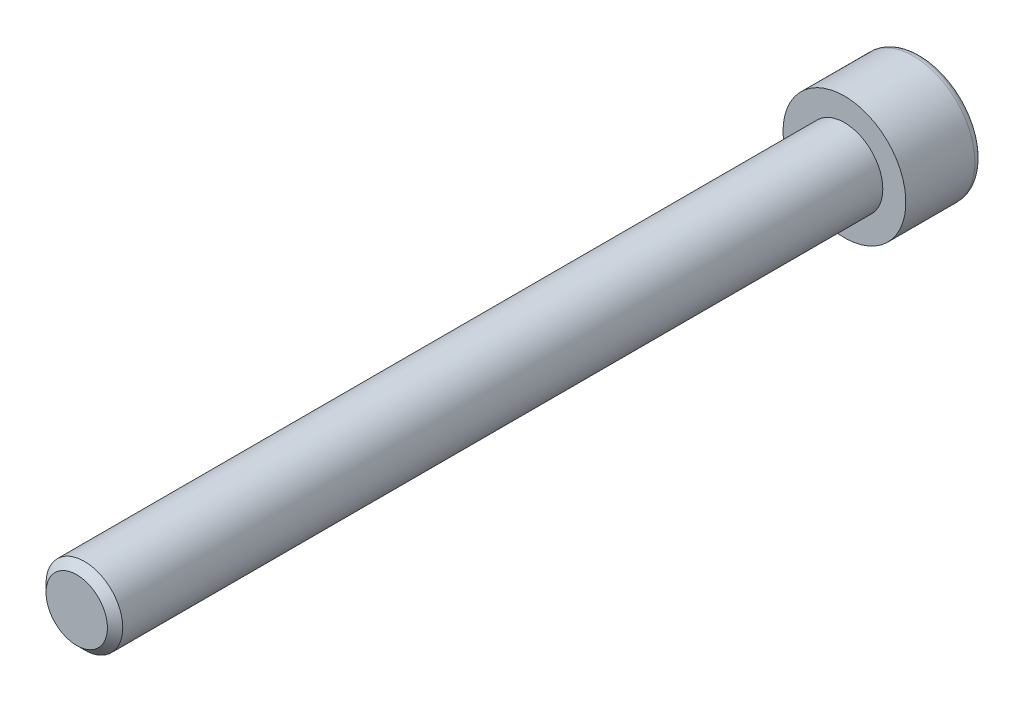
ISO-10303-21;
HEADER;
FILE_DESCRIPTION(('STEP AP214'),'2;1');
FILE_NAME('part.step','',(''),(''),'','','');
FILE_SCHEMA(('AUTOMOTIVE_DESIGN { 1 0 10303 214 1 1 1 1 }'));
ENDSEC;
DATA;
#1=APPLICATION_CONTEXT('core data for automotive mechanical design processes');
#2=APPLICATION_PROTOCOL_DEFINITION('international standard','automotive_design',2000,#1);
#3=PRODUCT_CONTEXT('',#1,'mechanical');
#4=PRODUCT('Part','Part','',(#3));
#5=PRODUCT_RELATED_PRODUCT_CATEGORY('part','',(#4));
#6=PRODUCT_DEFINITION_FORMATION('','',#4);
#7=PRODUCT_DEFINITION_CONTEXT('part definition',#1,'design');
#8=PRODUCT_DEFINITION('design','',#6,#7);
#9=PRODUCT_DEFINITION_SHAPE('','',#8);
#10=(LENGTH_UNIT() NAMED_UNIT(*) SI_UNIT(.MILLI.,.METRE.));
#11=(NAMED_UNIT(*) PLANE_ANGLE_UNIT() SI_UNIT($,.RADIAN.));
#12=(NAMED_UNIT(*) SI_UNIT($,.STERADIAN.) SOLID_ANGLE_UNIT());
#13=UNCERTAINTY_MEASURE_WITH_UNIT(LENGTH_MEASURE(1.E-05),#10,'distance_accuracy_value','');
#14=(GEOMETRIC_REPRESENTATION_CONTEXT(3) GLOBAL_UNCERTAINTY_ASSIGNED_CONTEXT((#13)) GLOBAL_UNIT_ASSIGNED_CONTEXT((#10,
#11,#12)) REPRESENTATION_CONTEXT('',''));
#15=CARTESIAN_POINT('',(0.,0.,0.));
#16=DIRECTION('',(0.,0.,1.));
#17=DIRECTION('',(1.,0.,0.));
#18=AXIS2_PLACEMENT_3D('',#15,#16,#17);
#19=CARTESIAN_POINT('',(0.,0.,-10.));
#20=DIRECTION('',(0.,0.,1.));
#21=DIRECTION('',(1.,0.,0.));
#22=AXIS2_PLACEMENT_3D('',#19,#20,#21);
#23=PLANE('',#22);
#24=CARTESIAN_POINT('',(0.,0.,-10.));
#25=DIRECTION('',(0.,0.,-1.));
#26=DIRECTION('',(-1.,0.,0.));
#27=AXIS2_PLACEMENT_3D('',#24,#25,#26);
#28=CIRCLE('',#27,7.);
#29=CARTESIAN_POINT('',(-7.,0.,-10.));
#30=VERTEX_POINT('',#29);
#31=EDGE_CURVE('E143',#30,#30,#28,.T.);
#32=ORIENTED_EDGE('',*,*,#31,.T.);
#33=EDGE_LOOP('',(#32));
#34=FACE_BOUND('',#33,.T.);
#35=DIRECTION('',(-0.86602540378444,0.499999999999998,0.));
#36=VECTOR('',#35,1.);
#37=CARTESIAN_POINT('',(0.,4.61880215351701,-10.));
#38=LINE('',#37,#36);
#39=CARTESIAN_POINT('',(4.,2.30940107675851,-10.));
#40=VERTEX_POINT('',#39);
#41=CARTESIAN_POINT('',(0.,4.61880215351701,-10.));
#42=VERTEX_POINT('',#41);
#43=EDGE_CURVE('E47',#40,#42,#38,.T.);
#44=ORIENTED_EDGE('',*,*,#43,.T.);
#45=DIRECTION('',(-0.866025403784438,-0.500000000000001,0.));
#46=VECTOR('',#45,1.);
#47=CARTESIAN_POINT('',(0.,4.61880215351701,-10.));
#48=LINE('',#47,#46);
#49=CARTESIAN_POINT('',(-4.,2.30940107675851,-10.));
#50=VERTEX_POINT('',#49);
#51=EDGE_CURVE('E87',#42,#50,#48,.T.);
#52=ORIENTED_EDGE('',*,*,#51,.T.);
#53=DIRECTION('',(0.,-1.,0.));
#54=VECTOR('',#53,1.);
#55=CARTESIAN_POINT('',(-4.,-2.30940107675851,-10.));
#56=LINE('',#55,#54);
#57=CARTESIAN_POINT('',(-4.,-2.30940107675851,-10.));
#58=VERTEX_POINT('',#57);
#59=EDGE_CURVE('E95',#50,#58,#56,.T.);
#60=ORIENTED_EDGE('',*,*,#59,.T.);
#61=DIRECTION('',(0.866025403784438,-0.500000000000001,0.));
#62=VECTOR('',#61,1.);
#63=CARTESIAN_POINT('',(0.,-4.61880215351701,-10.));
#64=LINE('',#63,#62);
#65=CARTESIAN_POINT('',(0.,-4.61880215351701,-10.));
#66=VERTEX_POINT('',#65);
#67=EDGE_CURVE('E113',#58,#66,#64,.T.);
#68=ORIENTED_EDGE('',*,*,#67,.T.);
#69=DIRECTION('',(0.86602540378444,0.499999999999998,0.));
#70=VECTOR('',#69,1.);
#71=CARTESIAN_POINT('',(0.,-4.61880215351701,-10.));
#72=LINE('',#71,#70);
#73=CARTESIAN_POINT('',(4.,-2.30940107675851,-10.));
#74=VERTEX_POINT('',#73);
#75=EDGE_CURVE('E116',#66,#74,#72,.T.);
#76=ORIENTED_EDGE('',*,*,#75,.T.);
#77=DIRECTION('',(0.,1.,0.));
#78=VECTOR('',#77,1.);
#79=CARTESIAN_POINT('',(4.,-2.30940107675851,-10.));
#80=LINE('',#79,#78);
#81=EDGE_CURVE('E106',#74,#40,#80,.T.);
#82=ORIENTED_EDGE('',*,*,#81,.T.);
#83=EDGE_LOOP('',(#44,#52,#60,#68,#76,#82));
#84=FACE_BOUND('',#83,.T.);
#85=ADVANCED_FACE('F33',(#34,#84),#23,.F.);
#86=CARTESIAN_POINT('',(0.,0.,-9.));
#87=DIRECTION('',(0.,0.,-1.));
#88=DIRECTION('',(-1.,0.,0.));
#89=AXIS2_PLACEMENT_3D('',#86,#87,#88);
#90=TOROIDAL_SURFACE('',#89,7.,0.999999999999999);
#91=ORIENTED_EDGE('',*,*,#31,.F.);
#92=EDGE_LOOP('',(#91));
#93=FACE_BOUND('',#92,.T.);
#94=CARTESIAN_POINT('',(0.,0.,-9.));
#95=DIRECTION('',(0.,0.,-1.));
#96=DIRECTION('',(-1.,0.,0.));
#97=AXIS2_PLACEMENT_3D('',#94,#95,#96);
#98=CIRCLE('',#97,8.);
#99=CARTESIAN_POINT('',(-8.,0.,-9.));
#100=VERTEX_POINT('',#99);
#101=EDGE_CURVE('E140',#100,#100,#98,.T.);
#102=ORIENTED_EDGE('',*,*,#101,.T.);
#103=EDGE_LOOP('',(#102));
#104=FACE_BOUND('',#103,.T.);
#105=ADVANCED_FACE('F162',(#93,#104),#90,.T.);
#106=CARTESIAN_POINT('',(0.,0.,0.));
#107=DIRECTION('',(0.,0.,-1.));
#108=DIRECTION('',(-1.,0.,0.));
#109=AXIS2_PLACEMENT_3D('',#106,#107,#108);
#110=CYLINDRICAL_SURFACE('',#109,8.);
#111=ORIENTED_EDGE('',*,*,#101,.F.);
#112=EDGE_LOOP('',(#111));
#113=FACE_BOUND('',#112,.T.);
#114=CARTESIAN_POINT('',(0.,0.,0.));
#115=DIRECTION('',(0.,0.,-1.));
#116=DIRECTION('',(-1.,0.,0.));
#117=AXIS2_PLACEMENT_3D('',#114,#115,#116);
#118=CIRCLE('',#117,8.);
#119=CARTESIAN_POINT('',(-8.,0.,0.));
#120=VERTEX_POINT('',#119);
#121=EDGE_CURVE('E101',#120,#120,#118,.T.);
#122=ORIENTED_EDGE('',*,*,#121,.T.);
#123=EDGE_LOOP('',(#122));
#124=FACE_BOUND('',#123,.T.);
#125=ADVANCED_FACE('F167',(#113,#124),#110,.T.);
#126=CARTESIAN_POINT('',(0.,0.,0.));
#127=DIRECTION('',(0.,0.,-1.));
#128=DIRECTION('',(-1.,0.,0.));
#129=AXIS2_PLACEMENT_3D('',#126,#127,#128);
#130=PLANE('',#129);
#131=CARTESIAN_POINT('',(0.,0.,0.));
#132=DIRECTION('',(0.,0.,1.));
#133=DIRECTION('',(1.,0.,0.));
#134=AXIS2_PLACEMENT_3D('',#131,#132,#133);
#135=CIRCLE('',#134,5.);
#136=CARTESIAN_POINT('',(5.,0.,0.));
#137=VERTEX_POINT('',#136);
#138=EDGE_CURVE('E107',#137,#137,#135,.T.);
#139=ORIENTED_EDGE('',*,*,#138,.F.);
#140=EDGE_LOOP('',(#139));
#141=FACE_BOUND('',#140,.T.);
#142=ORIENTED_EDGE('',*,*,#121,.F.);
#143=EDGE_LOOP('',(#142));
#144=FACE_BOUND('',#143,.T.);
#145=ADVANCED_FACE('F175',(#141,#144),#130,.F.);
#146=CARTESIAN_POINT('',(0.,4.61880215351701,-5.));
#147=DIRECTION('',(-0.499999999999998,-0.86602540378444,0.));
#148=DIRECTION('',(0.86602540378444,-0.499999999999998,0.));
#149=AXIS2_PLACEMENT_3D('',#146,#147,#148);
#150=PLANE('',#149);
#151=ORIENTED_EDGE('',*,*,#43,.F.);
#152=DIRECTION('',(0.,0.,-1.));
#153=VECTOR('',#152,1.);
#154=CARTESIAN_POINT('',(4.,2.30940107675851,-5.));
#155=LINE('',#154,#153);
#156=CARTESIAN_POINT('',(4.,2.30940107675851,-5.));
#157=VERTEX_POINT('',#156);
#158=EDGE_CURVE('E129',#157,#40,#155,.T.);
#159=ORIENTED_EDGE('',*,*,#158,.F.);
#160=DIRECTION('',(-0.86602540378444,0.499999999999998,0.));
#161=VECTOR('',#160,1.);
#162=CARTESIAN_POINT('',(0.,4.61880215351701,-5.));
#163=LINE('',#162,#161);
#164=CARTESIAN_POINT('',(0.,4.61880215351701,-5.));
#165=VERTEX_POINT('',#164);
#166=EDGE_CURVE('E100',#157,#165,#163,.T.);
#167=ORIENTED_EDGE('',*,*,#166,.T.);
#168=DIRECTION('',(0.,0.,-1.));
#169=VECTOR('',#168,1.);
#170=CARTESIAN_POINT('',(0.,4.61880215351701,-5.));
#171=LINE('',#170,#169);
#172=EDGE_CURVE('E89',#165,#42,#171,.T.);
#173=ORIENTED_EDGE('',*,*,#172,.T.);
#174=EDGE_LOOP('',(#151,#159,#167,#173));
#175=FACE_BOUND('',#174,.T.);
#176=ADVANCED_FACE('F98',(#175),#150,.T.);
#177=CARTESIAN_POINT('',(0.,4.61880215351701,-5.));
#178=DIRECTION('',(0.500000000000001,-0.866025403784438,0.));
#179=DIRECTION('',(0.866025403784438,0.500000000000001,0.));
#180=AXIS2_PLACEMENT_3D('',#177,#178,#179);
#181=PLANE('',#180);
#182=ORIENTED_EDGE('',*,*,#51,.F.);
#183=ORIENTED_EDGE('',*,*,#172,.F.);
#184=DIRECTION('',(-0.866025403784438,-0.500000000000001,0.));
#185=VECTOR('',#184,1.);
#186=CARTESIAN_POINT('',(0.,4.61880215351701,-5.));
#187=LINE('',#186,#185);
#188=CARTESIAN_POINT('',(-4.,2.30940107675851,-5.));
#189=VERTEX_POINT('',#188);
#190=EDGE_CURVE('E120',#165,#189,#187,.T.);
#191=ORIENTED_EDGE('',*,*,#190,.T.);
#192=DIRECTION('',(0.,0.,-1.));
#193=VECTOR('',#192,1.);
#194=CARTESIAN_POINT('',(-4.,2.30940107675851,-5.));
#195=LINE('',#194,#193);
#196=EDGE_CURVE('E91',#189,#50,#195,.T.);
#197=ORIENTED_EDGE('',*,*,#196,.T.);
#198=EDGE_LOOP('',(#182,#183,#191,#197));
#199=FACE_BOUND('',#198,.T.);
#200=ADVANCED_FACE('F88',(#199),#181,.T.);
#201=CARTESIAN_POINT('',(-4.,-2.30940107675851,-5.));
#202=DIRECTION('',(1.,0.,0.));
#203=DIRECTION('',(0.,0.,-1.));
#204=AXIS2_PLACEMENT_3D('',#201,#202,#203);
#205=PLANE('',#204);
#206=ORIENTED_EDGE('',*,*,#59,.F.);
#207=ORIENTED_EDGE('',*,*,#196,.F.);
#208=DIRECTION('',(0.,-1.,0.));
#209=VECTOR('',#208,1.);
#210=CARTESIAN_POINT('',(-4.,-2.30940107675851,-5.));
#211=LINE('',#210,#209);
#212=CARTESIAN_POINT('',(-4.,-2.30940107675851,-5.));
#213=VERTEX_POINT('',#212);
#214=EDGE_CURVE('E122',#189,#213,#211,.T.);
#215=ORIENTED_EDGE('',*,*,#214,.T.);
#216=DIRECTION('',(0.,0.,-1.));
#217=VECTOR('',#216,1.);
#218=CARTESIAN_POINT('',(-4.,-2.30940107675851,-5.));
#219=LINE('',#218,#217);
#220=EDGE_CURVE('E135',#213,#58,#219,.T.);
#221=ORIENTED_EDGE('',*,*,#220,.T.);
#222=EDGE_LOOP('',(#206,#207,#215,#221));
#223=FACE_BOUND('',#222,.T.);
#224=ADVANCED_FACE('F190',(#223),#205,.T.);
#225=CARTESIAN_POINT('',(0.,-4.61880215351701,-5.));
#226=DIRECTION('',(0.500000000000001,0.866025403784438,0.));
#227=DIRECTION('',(-0.866025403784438,0.500000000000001,0.));
#228=AXIS2_PLACEMENT_3D('',#225,#226,#227);
#229=PLANE('',#228);
#230=ORIENTED_EDGE('',*,*,#67,.F.);
#231=ORIENTED_EDGE('',*,*,#220,.F.);
#232=DIRECTION('',(0.866025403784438,-0.500000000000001,0.));
#233=VECTOR('',#232,1.);
#234=CARTESIAN_POINT('',(0.,-4.61880215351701,-5.));
#235=LINE('',#234,#233);
#236=CARTESIAN_POINT('',(0.,-4.61880215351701,-5.));
#237=VERTEX_POINT('',#236);
#238=EDGE_CURVE('E124',#213,#237,#235,.T.);
#239=ORIENTED_EDGE('',*,*,#238,.T.);
#240=DIRECTION('',(0.,0.,-1.));
#241=VECTOR('',#240,1.);
#242=CARTESIAN_POINT('',(0.,-4.61880215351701,-5.));
#243=LINE('',#242,#241);
#244=EDGE_CURVE('E133',#237,#66,#243,.T.);
#245=ORIENTED_EDGE('',*,*,#244,.T.);
#246=EDGE_LOOP('',(#230,#231,#239,#245));
#247=FACE_BOUND('',#246,.T.);
#248=ADVANCED_FACE('F193',(#247),#229,.T.);
#249=CARTESIAN_POINT('',(0.,-4.61880215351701,-5.));
#250=DIRECTION('',(-0.499999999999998,0.86602540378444,0.));
#251=DIRECTION('',(-0.86602540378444,-0.499999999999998,0.));
#252=AXIS2_PLACEMENT_3D('',#249,#250,#251);
#253=PLANE('',#252);
#254=ORIENTED_EDGE('',*,*,#75,.F.);
#255=ORIENTED_EDGE('',*,*,#244,.F.);
#256=DIRECTION('',(0.86602540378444,0.499999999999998,0.));
#257=VECTOR('',#256,1.);
#258=CARTESIAN_POINT('',(0.,-4.61880215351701,-5.));
#259=LINE('',#258,#257);
#260=CARTESIAN_POINT('',(4.,-2.30940107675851,-5.));
#261=VERTEX_POINT('',#260);
#262=EDGE_CURVE('E126',#237,#261,#259,.T.);
#263=ORIENTED_EDGE('',*,*,#262,.T.);
#264=DIRECTION('',(0.,0.,-1.));
#265=VECTOR('',#264,1.);
#266=CARTESIAN_POINT('',(4.,-2.30940107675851,-5.));
#267=LINE('',#266,#265);
#268=EDGE_CURVE('E131',#261,#74,#267,.T.);
#269=ORIENTED_EDGE('',*,*,#268,.T.);
#270=EDGE_LOOP('',(#254,#255,#263,#269));
#271=FACE_BOUND('',#270,.T.);
#272=ADVANCED_FACE('F197',(#271),#253,.T.);
#273=CARTESIAN_POINT('',(4.,-2.30940107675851,-5.));
#274=DIRECTION('',(-1.,0.,0.));
#275=DIRECTION('',(0.,-1.,0.));
#276=AXIS2_PLACEMENT_3D('',#273,#274,#275);
#277=PLANE('',#276);
#278=ORIENTED_EDGE('',*,*,#81,.F.);
#279=ORIENTED_EDGE('',*,*,#268,.F.);
#280=DIRECTION('',(0.,1.,0.));
#281=VECTOR('',#280,1.);
#282=CARTESIAN_POINT('',(4.,-2.30940107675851,-5.));
#283=LINE('',#282,#281);
#284=EDGE_CURVE('E54',#261,#157,#283,.T.);
#285=ORIENTED_EDGE('',*,*,#284,.T.);
#286=ORIENTED_EDGE('',*,*,#158,.T.);
#287=EDGE_LOOP('',(#278,#279,#285,#286));
#288=FACE_BOUND('',#287,.T.);
#289=ADVANCED_FACE('F201',(#288),#277,.T.);
#290=CARTESIAN_POINT('',(4.,2.30940107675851,-5.));
#291=DIRECTION('',(0.,0.,1.));
#292=DIRECTION('',(1.,0.,0.));
#293=AXIS2_PLACEMENT_3D('',#290,#291,#292);
#294=PLANE('',#293);
#295=ORIENTED_EDGE('',*,*,#166,.F.);
#296=ORIENTED_EDGE('',*,*,#284,.F.);
#297=ORIENTED_EDGE('',*,*,#262,.F.);
#298=ORIENTED_EDGE('',*,*,#238,.F.);
#299=ORIENTED_EDGE('',*,*,#214,.F.);
#300=ORIENTED_EDGE('',*,*,#190,.F.);
#301=EDGE_LOOP('',(#295,#296,#297,#298,#299,#300));
#302=FACE_BOUND('',#301,.T.);
#303=ADVANCED_FACE('F205',(#302),#294,.F.);
#304=CARTESIAN_POINT('',(0.,0.,100.));
#305=DIRECTION('',(0.,0.,1.));
#306=DIRECTION('',(1.,0.,0.));
#307=AXIS2_PLACEMENT_3D('',#304,#305,#306);
#308=PLANE('',#307);
#309=CARTESIAN_POINT('',(0.,0.,100.));
#310=DIRECTION('',(0.,0.,1.));
#311=DIRECTION('',(1.,0.,0.));
#312=AXIS2_PLACEMENT_3D('',#309,#310,#311);
#313=CIRCLE('',#312,4.00000000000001);
#314=CARTESIAN_POINT('',(4.00000000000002,0.,100.));
#315=VERTEX_POINT('',#314);
#316=EDGE_CURVE('E40',#315,#315,#313,.T.);
#317=ORIENTED_EDGE('',*,*,#316,.T.);
#318=EDGE_LOOP('',(#317));
#319=FACE_BOUND('',#318,.T.);
#320=ADVANCED_FACE('F148',(#319),#308,.T.);
#321=CARTESIAN_POINT('',(0.,0.,0.));
#322=DIRECTION('',(0.,0.,1.));
#323=DIRECTION('',(1.,0.,0.));
#324=AXIS2_PLACEMENT_3D('',#321,#322,#323);
#325=CYLINDRICAL_SURFACE('',#324,5.);
#326=CARTESIAN_POINT('',(0.,0.,99.));
#327=DIRECTION('',(0.,0.,1.));
#328=DIRECTION('',(1.,0.,0.));
#329=AXIS2_PLACEMENT_3D('',#326,#327,#328);
#330=CIRCLE('',#329,5.);
#331=CARTESIAN_POINT('',(5.00000000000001,0.,99.));
#332=VERTEX_POINT('',#331);
#333=EDGE_CURVE('E11',#332,#332,#330,.F.);
#334=ORIENTED_EDGE('',*,*,#333,.T.);
#335=EDGE_LOOP('',(#334));
#336=FACE_BOUND('',#335,.T.);
#337=ORIENTED_EDGE('',*,*,#138,.T.);
#338=EDGE_LOOP('',(#337));
#339=FACE_BOUND('',#338,.T.);
#340=ADVANCED_FACE('F152',(#336,#339),#325,.T.);
#341=CARTESIAN_POINT('',(0.,0.,100.));
#342=DIRECTION('',(0.,0.,-1.));
#343=DIRECTION('',(-1.,0.,0.));
#344=AXIS2_PLACEMENT_3D('',#341,#342,#343);
#345=CONICAL_SURFACE('',#344,4.00000000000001,0.785398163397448);
#346=ORIENTED_EDGE('',*,*,#333,.F.);
#347=EDGE_LOOP('',(#346));
#348=FACE_BOUND('',#347,.T.);
#349=ORIENTED_EDGE('',*,*,#316,.F.);
#350=EDGE_LOOP('',(#349));
#351=FACE_BOUND('',#350,.T.);
#352=ADVANCED_FACE('F150',(#348,#351),#345,.T.);
#353=CLOSED_SHELL('',(#85,#105,#125,#145,#176,#200,#224,#248,#272,#289,#303,#320,#340,#352));
#354=MANIFOLD_SOLID_BREP('B2',#353);
#355=ADVANCED_BREP_SHAPE_REPRESENTATION('',(#18,#354),#14);
#356=SHAPE_DEFINITION_REPRESENTATION(#9,#355);
ENDSEC;
END-ISO-10303-21;
